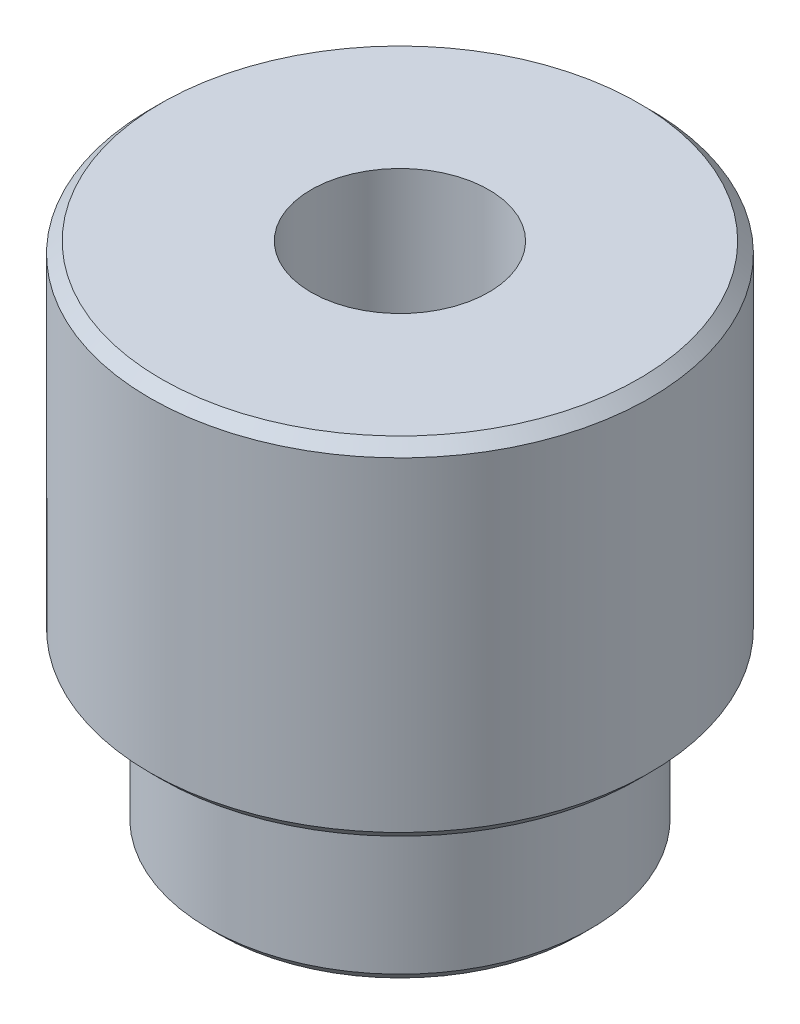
ISO-10303-21;
HEADER;
FILE_DESCRIPTION(('STEP AP214'),'2;1');
FILE_NAME('part.step','',(''),(''),'','','');
FILE_SCHEMA(('AUTOMOTIVE_DESIGN { 1 0 10303 214 1 1 1 1 }'));
ENDSEC;
DATA;
#1=APPLICATION_CONTEXT('core data for automotive mechanical design processes');
#2=APPLICATION_PROTOCOL_DEFINITION('international standard','automotive_design',2000,#1);
#3=PRODUCT_CONTEXT('',#1,'mechanical');
#4=PRODUCT('Part','Part','',(#3));
#5=PRODUCT_RELATED_PRODUCT_CATEGORY('part','',(#4));
#6=PRODUCT_DEFINITION_FORMATION('','',#4);
#7=PRODUCT_DEFINITION_CONTEXT('part definition',#1,'design');
#8=PRODUCT_DEFINITION('design','',#6,#7);
#9=PRODUCT_DEFINITION_SHAPE('','',#8);
#10=(LENGTH_UNIT() NAMED_UNIT(*) SI_UNIT(.MILLI.,.METRE.));
#11=(NAMED_UNIT(*) PLANE_ANGLE_UNIT() SI_UNIT($,.RADIAN.));
#12=(NAMED_UNIT(*) SI_UNIT($,.STERADIAN.) SOLID_ANGLE_UNIT());
#13=UNCERTAINTY_MEASURE_WITH_UNIT(LENGTH_MEASURE(1.E-05),#10,'distance_accuracy_value','');
#14=(GEOMETRIC_REPRESENTATION_CONTEXT(3) GLOBAL_UNCERTAINTY_ASSIGNED_CONTEXT((#13)) GLOBAL_UNIT_ASSIGNED_CONTEXT((#10,
#11,#12)) REPRESENTATION_CONTEXT('',''));
#15=CARTESIAN_POINT('',(0.,0.,0.));
#16=DIRECTION('',(0.,0.,1.));
#17=DIRECTION('',(1.,0.,0.));
#18=AXIS2_PLACEMENT_3D('',#15,#16,#17);
#19=CARTESIAN_POINT('',(0.,-3.12,0.));
#20=DIRECTION('',(0.,1.,0.));
#21=DIRECTION('',(0.,0.,1.));
#22=AXIS2_PLACEMENT_3D('',#19,#20,#21);
#23=CYLINDRICAL_SURFACE('',#22,2.25);
#24=CARTESIAN_POINT('',(0.,-0.0999999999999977,0.));
#25=DIRECTION('',(0.,1.,0.));
#26=DIRECTION('',(0.,0.,1.));
#27=AXIS2_PLACEMENT_3D('',#24,#25,#26);
#28=CIRCLE('',#27,2.25);
#29=CARTESIAN_POINT('',(0.,-0.0999999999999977,2.25));
#30=VERTEX_POINT('',#29);
#31=EDGE_CURVE('E46',#30,#30,#28,.F.);
#32=CARTESIAN_POINT('',(0.,-3.02,0.));
#33=DIRECTION('',(0.,1.,0.));
#34=DIRECTION('',(0.,0.,1.));
#35=AXIS2_PLACEMENT_3D('',#32,#33,#34);
#36=CIRCLE('',#35,2.25);
#37=CARTESIAN_POINT('',(0.,-3.02,2.25));
#38=VERTEX_POINT('',#37);
#39=EDGE_CURVE('E51',#38,#38,#36,.T.);
#40=CARTESIAN_POINT('',(0.,-0.0999999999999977,2.25));
#41=CARTESIAN_POINT('',(0.,-0.130416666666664,2.25));
#42=CARTESIAN_POINT('',(0.,-0.160833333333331,2.25));
#43=CARTESIAN_POINT('',(0.,-0.221666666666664,2.25));
#44=CARTESIAN_POINT('',(0.,-0.252083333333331,2.25));
#45=CARTESIAN_POINT('',(0.,-0.312916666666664,2.25));
#46=CARTESIAN_POINT('',(0.,-0.343333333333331,2.25));
#47=CARTESIAN_POINT('',(0.,-0.404166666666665,2.25));
#48=CARTESIAN_POINT('',(0.,-0.434583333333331,2.25));
#49=CARTESIAN_POINT('',(0.,-0.495416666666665,2.25));
#50=CARTESIAN_POINT('',(0.,-0.525833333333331,2.25));
#51=CARTESIAN_POINT('',(0.,-0.586666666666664,2.25));
#52=CARTESIAN_POINT('',(0.,-0.617083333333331,2.25));
#53=CARTESIAN_POINT('',(0.,-0.677916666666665,2.25));
#54=CARTESIAN_POINT('',(0.,-0.708333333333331,2.25));
#55=CARTESIAN_POINT('',(0.,-0.769166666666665,2.25));
#56=CARTESIAN_POINT('',(0.,-0.799583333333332,2.25));
#57=CARTESIAN_POINT('',(0.,-0.860416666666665,2.25));
#58=CARTESIAN_POINT('',(0.,-0.890833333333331,2.25));
#59=CARTESIAN_POINT('',(0.,-0.951666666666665,2.25));
#60=CARTESIAN_POINT('',(0.,-0.982083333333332,2.25));
#61=CARTESIAN_POINT('',(0.,-1.04291666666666,2.25));
#62=CARTESIAN_POINT('',(0.,-1.07333333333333,2.25));
#63=CARTESIAN_POINT('',(0.,-1.13416666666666,2.25));
#64=CARTESIAN_POINT('',(0.,-1.16458333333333,2.25));
#65=CARTESIAN_POINT('',(0.,-1.22541666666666,2.25));
#66=CARTESIAN_POINT('',(0.,-1.25583333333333,2.25));
#67=CARTESIAN_POINT('',(0.,-1.31666666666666,2.25));
#68=CARTESIAN_POINT('',(0.,-1.34708333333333,2.25));
#69=CARTESIAN_POINT('',(0.,-1.40791666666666,2.25));
#70=CARTESIAN_POINT('',(0.,-1.43833333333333,2.25));
#71=CARTESIAN_POINT('',(0.,-1.49916666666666,2.25));
#72=CARTESIAN_POINT('',(0.,-1.52958333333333,2.25));
#73=CARTESIAN_POINT('',(0.,-1.59041666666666,2.25));
#74=CARTESIAN_POINT('',(0.,-1.62083333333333,2.25));
#75=CARTESIAN_POINT('',(0.,-1.68166666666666,2.25));
#76=CARTESIAN_POINT('',(0.,-1.71208333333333,2.25));
#77=CARTESIAN_POINT('',(0.,-1.77291666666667,2.25));
#78=CARTESIAN_POINT('',(0.,-1.80333333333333,2.25));
#79=CARTESIAN_POINT('',(0.,-1.86416666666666,2.25));
#80=CARTESIAN_POINT('',(0.,-1.89458333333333,2.25));
#81=CARTESIAN_POINT('',(0.,-1.95541666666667,2.25));
#82=CARTESIAN_POINT('',(0.,-1.98583333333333,2.25));
#83=CARTESIAN_POINT('',(0.,-2.04666666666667,2.25));
#84=CARTESIAN_POINT('',(0.,-2.07708333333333,2.25));
#85=CARTESIAN_POINT('',(0.,-2.13791666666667,2.25));
#86=CARTESIAN_POINT('',(0.,-2.16833333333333,2.25));
#87=CARTESIAN_POINT('',(0.,-2.22916666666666,2.25));
#88=CARTESIAN_POINT('',(0.,-2.25958333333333,2.25));
#89=CARTESIAN_POINT('',(0.,-2.32041666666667,2.25));
#90=CARTESIAN_POINT('',(0.,-2.35083333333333,2.25));
#91=CARTESIAN_POINT('',(0.,-2.41166666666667,2.25));
#92=CARTESIAN_POINT('',(0.,-2.44208333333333,2.25));
#93=CARTESIAN_POINT('',(0.,-2.50291666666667,2.25));
#94=CARTESIAN_POINT('',(0.,-2.53333333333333,2.25));
#95=CARTESIAN_POINT('',(0.,-2.59416666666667,2.25));
#96=CARTESIAN_POINT('',(0.,-2.62458333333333,2.25));
#97=CARTESIAN_POINT('',(0.,-2.68541666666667,2.25));
#98=CARTESIAN_POINT('',(0.,-2.71583333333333,2.25));
#99=CARTESIAN_POINT('',(0.,-2.77666666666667,2.25));
#100=CARTESIAN_POINT('',(0.,-2.80708333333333,2.25));
#101=CARTESIAN_POINT('',(0.,-2.86791666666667,2.25));
#102=CARTESIAN_POINT('',(0.,-2.89833333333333,2.25));
#103=CARTESIAN_POINT('',(0.,-2.95916666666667,2.25));
#104=CARTESIAN_POINT('',(0.,-2.98958333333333,2.25));
#105=CARTESIAN_POINT('',(0.,-3.02,2.25));
#106=B_SPLINE_CURVE_WITH_KNOTS('',3,(#40,#41,#42,#43,#44,#45,#46,#47,#48,#49,#50,#51,#52,#53,
#54,#55,#56,#57,#58,#59,#60,#61,#62,#63,#64,#65,#66,#67,#68,#69,#70,#71,#72,#73,#74,#75,#76,#77,
#78,#79,#80,#81,#82,#83,#84,#85,#86,#87,#88,#89,#90,#91,#92,#93,#94,#95,#96,#97,#98,#99,#100,
#101,#102,#103,#104,#105),.UNSPECIFIED.,.F.,.F.,(4,2,2,2,2,2,2,2,2,2,2,2,2,2,2,2,2,2,2,2,2,2,2,
2,2,2,2,2,2,2,2,2,4),(0.,0.0912500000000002,0.1825,0.27375,0.365,0.45625,0.5475,0.63875,
0.730000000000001,0.82125,0.912500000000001,1.00375,1.095,1.18625,1.2775,1.36875,1.46,1.55125,
1.6425,1.73375,1.825,1.91625,2.0075,2.09875,2.19,2.28125,2.3725,2.46375,2.555,2.64625,2.7375,
2.82875,2.92),.UNSPECIFIED.);
#107=EDGE_CURVE('BSEAM31',#30,#38,#106,.T.);
#108=ORIENTED_EDGE('',*,*,#31,.T.);
#109=ORIENTED_EDGE('',*,*,#39,.T.);
#110=ORIENTED_EDGE('',*,*,#107,.T.);
#111=ORIENTED_EDGE('',*,*,#107,.F.);
#112=EDGE_LOOP('',(#108,#110,#109,#111));
#113=FACE_BOUND('',#112,.T.);
#114=ADVANCED_FACE('F31',(#113),#23,.T.);
#115=CARTESIAN_POINT('',(0.,-3.12,0.));
#116=DIRECTION('',(0.,1.,0.));
#117=DIRECTION('',(0.,0.,1.));
#118=AXIS2_PLACEMENT_3D('',#115,#116,#117);
#119=PLANE('',#118);
#120=CARTESIAN_POINT('',(0.,-3.12,0.));
#121=DIRECTION('',(0.,1.,0.));
#122=DIRECTION('',(0.,0.,1.));
#123=AXIS2_PLACEMENT_3D('',#120,#121,#122);
#124=CIRCLE('',#123,2.15);
#125=CARTESIAN_POINT('',(0.,-3.12,2.15));
#126=VERTEX_POINT('',#125);
#127=EDGE_CURVE('E10',#126,#126,#124,.F.);
#128=ORIENTED_EDGE('',*,*,#127,.T.);
#129=EDGE_LOOP('',(#128));
#130=FACE_BOUND('',#129,.T.);
#131=CARTESIAN_POINT('',(0.,-3.12,0.));
#132=DIRECTION('',(0.,-1.,0.));
#133=DIRECTION('',(0.,0.,-1.));
#134=AXIS2_PLACEMENT_3D('',#131,#132,#133);
#135=CIRCLE('',#134,1.72);
#136=CARTESIAN_POINT('',(0.,-3.12,-1.72));
#137=VERTEX_POINT('',#136);
#138=EDGE_CURVE('E57',#137,#137,#135,.T.);
#139=ORIENTED_EDGE('',*,*,#138,.F.);
#140=EDGE_LOOP('',(#139));
#141=FACE_BOUND('',#140,.T.);
#142=ADVANCED_FACE('F72',(#130,#141),#119,.F.);
#143=CARTESIAN_POINT('',(0.,0.,0.));
#144=DIRECTION('',(0.,1.,0.));
#145=DIRECTION('',(0.,0.,1.));
#146=AXIS2_PLACEMENT_3D('',#143,#144,#145);
#147=PLANE('',#146);
#148=CARTESIAN_POINT('',(0.,0.,0.));
#149=DIRECTION('',(0.,1.,0.));
#150=DIRECTION('',(0.,0.,1.));
#151=AXIS2_PLACEMENT_3D('',#148,#149,#150);
#152=CIRCLE('',#151,2.15);
#153=CARTESIAN_POINT('',(0.,0.,2.15));
#154=VERTEX_POINT('',#153);
#155=EDGE_CURVE('E54',#154,#154,#152,.T.);
#156=ORIENTED_EDGE('',*,*,#155,.T.);
#157=EDGE_LOOP('',(#156));
#158=FACE_BOUND('',#157,.T.);
#159=CARTESIAN_POINT('',(0.,0.,0.));
#160=DIRECTION('',(0.,1.,0.));
#161=DIRECTION('',(0.,0.,1.));
#162=AXIS2_PLACEMENT_3D('',#159,#160,#161);
#163=CIRCLE('',#162,0.799999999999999);
#164=CARTESIAN_POINT('',(0.,0.,0.799999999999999));
#165=VERTEX_POINT('',#164);
#166=EDGE_CURVE('E63',#165,#165,#163,.T.);
#167=ORIENTED_EDGE('',*,*,#166,.F.);
#168=EDGE_LOOP('',(#167));
#169=FACE_BOUND('',#168,.T.);
#170=ADVANCED_FACE('F69',(#158,#169),#147,.T.);
#171=CARTESIAN_POINT('',(0.,-4.6,0.));
#172=DIRECTION('',(0.,1.,0.));
#173=DIRECTION('',(0.,0.,1.));
#174=AXIS2_PLACEMENT_3D('',#171,#172,#173);
#175=CYLINDRICAL_SURFACE('',#174,1.72);
#176=CARTESIAN_POINT('',(0.,-4.5,0.));
#177=DIRECTION('',(0.,-1.,0.));
#178=DIRECTION('',(0.,0.,-1.));
#179=AXIS2_PLACEMENT_3D('',#176,#177,#178);
#180=CIRCLE('',#179,1.72);
#181=CARTESIAN_POINT('',(0.,-4.5,-1.72));
#182=VERTEX_POINT('',#181);
#183=EDGE_CURVE('E38',#182,#182,#180,.F.);
#184=ORIENTED_EDGE('',*,*,#183,.T.);
#185=EDGE_LOOP('',(#184));
#186=FACE_BOUND('',#185,.T.);
#187=ORIENTED_EDGE('',*,*,#138,.T.);
#188=EDGE_LOOP('',(#187));
#189=FACE_BOUND('',#188,.T.);
#190=ADVANCED_FACE('F71',(#186,#189),#175,.T.);
#191=CARTESIAN_POINT('',(0.,-4.6,0.));
#192=DIRECTION('',(0.,-1.,0.));
#193=DIRECTION('',(0.,0.,-1.));
#194=AXIS2_PLACEMENT_3D('',#191,#192,#193);
#195=PLANE('',#194);
#196=CARTESIAN_POINT('',(0.,-4.6,0.));
#197=DIRECTION('',(0.,-1.,0.));
#198=DIRECTION('',(0.,0.,-1.));
#199=AXIS2_PLACEMENT_3D('',#196,#197,#198);
#200=CIRCLE('',#199,1.62);
#201=CARTESIAN_POINT('',(0.,-4.6,-1.62));
#202=VERTEX_POINT('',#201);
#203=EDGE_CURVE('E42',#202,#202,#200,.T.);
#204=ORIENTED_EDGE('',*,*,#203,.T.);
#205=EDGE_LOOP('',(#204));
#206=FACE_BOUND('',#205,.T.);
#207=CARTESIAN_POINT('',(0.,-4.6,0.));
#208=DIRECTION('',(0.,1.,0.));
#209=DIRECTION('',(0.,0.,1.));
#210=AXIS2_PLACEMENT_3D('',#207,#208,#209);
#211=CIRCLE('',#210,0.799999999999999);
#212=CARTESIAN_POINT('',(0.,-4.6,0.799999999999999));
#213=VERTEX_POINT('',#212);
#214=EDGE_CURVE('E60',#213,#213,#211,.T.);
#215=ORIENTED_EDGE('',*,*,#214,.T.);
#216=EDGE_LOOP('',(#215));
#217=FACE_BOUND('',#216,.T.);
#218=ADVANCED_FACE('F79',(#206,#217),#195,.T.);
#219=CARTESIAN_POINT('',(0.,0.,0.));
#220=DIRECTION('',(0.,1.,0.));
#221=DIRECTION('',(0.,0.,1.));
#222=AXIS2_PLACEMENT_3D('',#219,#220,#221);
#223=CYLINDRICAL_SURFACE('',#222,0.799999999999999);
#224=ORIENTED_EDGE('',*,*,#214,.F.);
#225=EDGE_LOOP('',(#224));
#226=FACE_BOUND('',#225,.T.);
#227=ORIENTED_EDGE('',*,*,#166,.T.);
#228=EDGE_LOOP('',(#227));
#229=FACE_BOUND('',#228,.T.);
#230=ADVANCED_FACE('F67',(#226,#229),#223,.F.);
#231=CARTESIAN_POINT('',(0.,0.,0.));
#232=DIRECTION('',(0.,-1.,0.));
#233=DIRECTION('',(0.,0.,-1.));
#234=AXIS2_PLACEMENT_3D('',#231,#232,#233);
#235=CONICAL_SURFACE('',#234,2.15,0.785398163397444);
#236=ORIENTED_EDGE('',*,*,#31,.F.);
#237=EDGE_LOOP('',(#236));
#238=FACE_BOUND('',#237,.T.);
#239=ORIENTED_EDGE('',*,*,#155,.F.);
#240=EDGE_LOOP('',(#239));
#241=FACE_BOUND('',#240,.T.);
#242=ADVANCED_FACE('F89',(#238,#241),#235,.T.);
#243=CARTESIAN_POINT('',(0.,-4.6,0.));
#244=DIRECTION('',(0.,1.,0.));
#245=DIRECTION('',(0.,0.,1.));
#246=AXIS2_PLACEMENT_3D('',#243,#244,#245);
#247=CONICAL_SURFACE('',#246,1.62,0.785398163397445);
#248=ORIENTED_EDGE('',*,*,#183,.F.);
#249=EDGE_LOOP('',(#248));
#250=FACE_BOUND('',#249,.T.);
#251=ORIENTED_EDGE('',*,*,#203,.F.);
#252=EDGE_LOOP('',(#251));
#253=FACE_BOUND('',#252,.T.);
#254=ADVANCED_FACE('F91',(#250,#253),#247,.T.);
#255=CARTESIAN_POINT('',(0.,-3.02,0.));
#256=DIRECTION('',(0.,1.,0.));
#257=DIRECTION('',(0.,0.,1.));
#258=AXIS2_PLACEMENT_3D('',#255,#256,#257);
#259=CONICAL_SURFACE('',#258,2.25,0.78539816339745);
#260=ORIENTED_EDGE('',*,*,#127,.F.);
#261=EDGE_LOOP('',(#260));
#262=FACE_BOUND('',#261,.T.);
#263=ORIENTED_EDGE('',*,*,#39,.F.);
#264=EDGE_LOOP('',(#263));
#265=FACE_BOUND('',#264,.T.);
#266=ADVANCED_FACE('F33',(#262,#265),#259,.T.);
#267=CLOSED_SHELL('',(#114,#142,#170,#190,#218,#230,#242,#254,#266));
#268=MANIFOLD_SOLID_BREP('B2',#267);
#269=ADVANCED_BREP_SHAPE_REPRESENTATION('',(#18,#268),#14);
#270=SHAPE_DEFINITION_REPRESENTATION(#9,#269);
ENDSEC;
END-ISO-10303-21;
